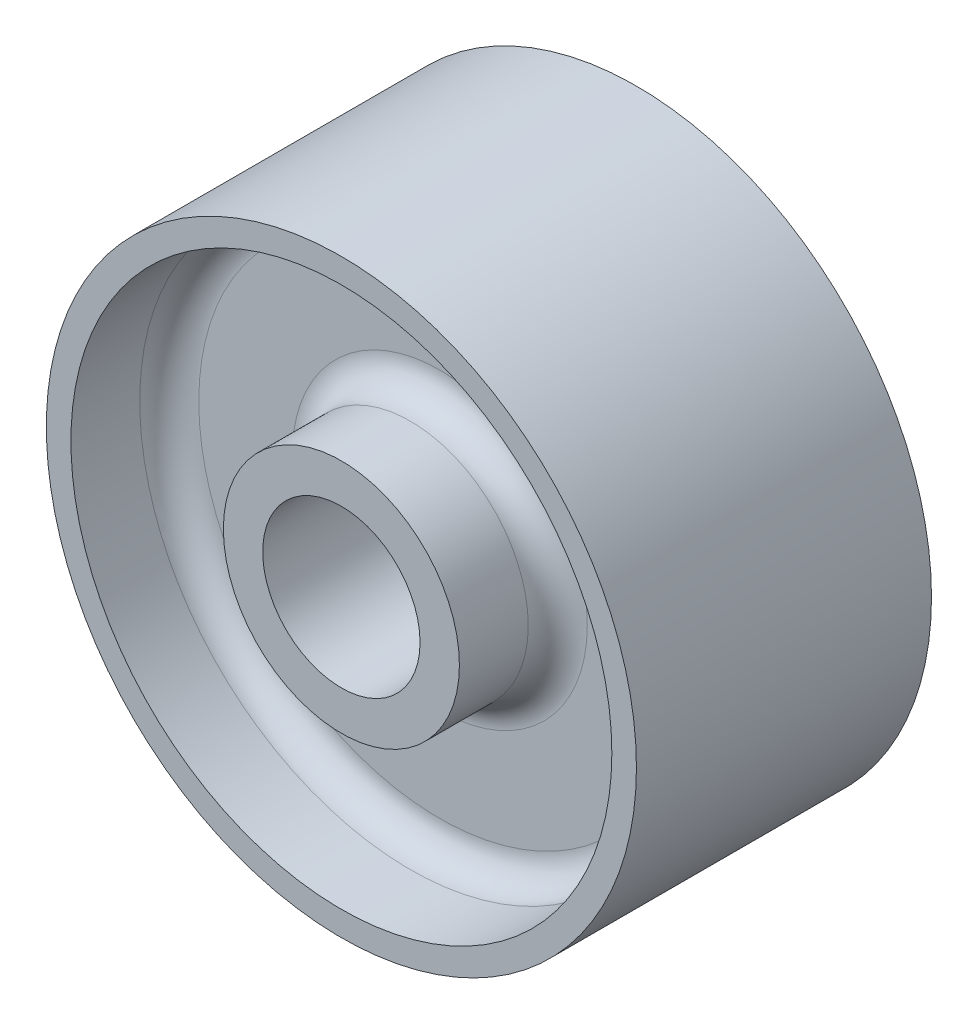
ISO-10303-21;
HEADER;
FILE_DESCRIPTION(('STEP AP214'),'2;1');
FILE_NAME('part.step','',(''),(''),'','','');
FILE_SCHEMA(('AUTOMOTIVE_DESIGN { 1 0 10303 214 1 1 1 1 }'));
ENDSEC;
DATA;
#1=APPLICATION_CONTEXT('core data for automotive mechanical design processes');
#2=APPLICATION_PROTOCOL_DEFINITION('international standard','automotive_design',2000,#1);
#3=PRODUCT_CONTEXT('',#1,'mechanical');
#4=PRODUCT('Part','Part','',(#3));
#5=PRODUCT_RELATED_PRODUCT_CATEGORY('part','',(#4));
#6=PRODUCT_DEFINITION_FORMATION('','',#4);
#7=PRODUCT_DEFINITION_CONTEXT('part definition',#1,'design');
#8=PRODUCT_DEFINITION('design','',#6,#7);
#9=PRODUCT_DEFINITION_SHAPE('','',#8);
#10=(LENGTH_UNIT() NAMED_UNIT(*) SI_UNIT(.MILLI.,.METRE.));
#11=(NAMED_UNIT(*) PLANE_ANGLE_UNIT() SI_UNIT($,.RADIAN.));
#12=(NAMED_UNIT(*) SI_UNIT($,.STERADIAN.) SOLID_ANGLE_UNIT());
#13=UNCERTAINTY_MEASURE_WITH_UNIT(LENGTH_MEASURE(1.E-05),#10,'distance_accuracy_value','');
#14=(GEOMETRIC_REPRESENTATION_CONTEXT(3) GLOBAL_UNCERTAINTY_ASSIGNED_CONTEXT((#13)) GLOBAL_UNIT_ASSIGNED_CONTEXT((#10,
#11,#12)) REPRESENTATION_CONTEXT('',''));
#15=CARTESIAN_POINT('',(0.,0.,0.));
#16=DIRECTION('',(0.,0.,1.));
#17=DIRECTION('',(1.,0.,0.));
#18=AXIS2_PLACEMENT_3D('',#15,#16,#17);
#19=CARTESIAN_POINT('',(0.,0.,0.));
#20=DIRECTION('',(0.,0.,1.));
#21=DIRECTION('',(1.,0.,0.));
#22=AXIS2_PLACEMENT_3D('',#19,#20,#21);
#23=PLANE('',#22);
#24=CARTESIAN_POINT('',(0.,0.,0.));
#25=DIRECTION('',(0.,0.,1.));
#26=DIRECTION('',(1.,0.,0.));
#27=AXIS2_PLACEMENT_3D('',#24,#25,#26);
#28=CIRCLE('',#27,16.);
#29=CARTESIAN_POINT('',(16.,0.,0.));
#30=VERTEX_POINT('',#29);
#31=EDGE_CURVE('E69',#30,#30,#28,.T.);
#32=ORIENTED_EDGE('',*,*,#31,.T.);
#33=EDGE_LOOP('',(#32));
#34=FACE_BOUND('',#33,.T.);
#35=CARTESIAN_POINT('',(0.,0.,0.));
#36=DIRECTION('',(0.,0.,-1.));
#37=DIRECTION('',(-1.,0.,0.));
#38=AXIS2_PLACEMENT_3D('',#35,#36,#37);
#39=CIRCLE('',#38,24.);
#40=CARTESIAN_POINT('',(-24.,0.,0.));
#41=VERTEX_POINT('',#40);
#42=EDGE_CURVE('E81',#41,#41,#39,.T.);
#43=ORIENTED_EDGE('',*,*,#42,.T.);
#44=EDGE_LOOP('',(#43));
#45=FACE_BOUND('',#44,.T.);
#46=ADVANCED_FACE('F28',(#34,#45),#23,.F.);
#47=CARTESIAN_POINT('',(0.,0.,60.));
#48=DIRECTION('',(0.,0.,1.));
#49=DIRECTION('',(1.,0.,0.));
#50=AXIS2_PLACEMENT_3D('',#47,#48,#49);
#51=PLANE('',#50);
#52=CARTESIAN_POINT('',(0.,0.,60.));
#53=DIRECTION('',(0.,0.,1.));
#54=DIRECTION('',(1.,0.,0.));
#55=AXIS2_PLACEMENT_3D('',#52,#53,#54);
#56=CIRCLE('',#55,16.);
#57=CARTESIAN_POINT('',(16.,0.,60.));
#58=VERTEX_POINT('',#57);
#59=EDGE_CURVE('E66',#58,#58,#56,.T.);
#60=ORIENTED_EDGE('',*,*,#59,.F.);
#61=EDGE_LOOP('',(#60));
#62=FACE_BOUND('',#61,.T.);
#63=CARTESIAN_POINT('',(0.,0.,60.));
#64=DIRECTION('',(0.,0.,1.));
#65=DIRECTION('',(1.,0.,0.));
#66=AXIS2_PLACEMENT_3D('',#63,#64,#65);
#67=CIRCLE('',#66,24.);
#68=CARTESIAN_POINT('',(24.,0.,60.));
#69=VERTEX_POINT('',#68);
#70=EDGE_CURVE('E75',#69,#69,#67,.T.);
#71=ORIENTED_EDGE('',*,*,#70,.T.);
#72=EDGE_LOOP('',(#71));
#73=FACE_BOUND('',#72,.T.);
#74=ADVANCED_FACE('F103',(#62,#73),#51,.T.);
#75=CARTESIAN_POINT('',(0.,0.,60.));
#76=DIRECTION('',(0.,0.,1.));
#77=DIRECTION('',(1.,0.,0.));
#78=AXIS2_PLACEMENT_3D('',#75,#76,#77);
#79=CIRCLE('',#78,55.);
#80=CARTESIAN_POINT('',(55.,0.,60.));
#81=VERTEX_POINT('',#80);
#82=EDGE_CURVE('E72',#81,#81,#79,.T.);
#83=ORIENTED_EDGE('',*,*,#82,.F.);
#84=EDGE_LOOP('',(#83));
#85=FACE_BOUND('',#84,.T.);
#86=CARTESIAN_POINT('',(0.,0.,60.));
#87=DIRECTION('',(0.,0.,1.));
#88=DIRECTION('',(1.,0.,0.));
#89=AXIS2_PLACEMENT_3D('',#86,#87,#88);
#90=CIRCLE('',#89,60.);
#91=CARTESIAN_POINT('',(60.,0.,60.));
#92=VERTEX_POINT('',#91);
#93=EDGE_CURVE('E60',#92,#92,#90,.T.);
#94=ORIENTED_EDGE('',*,*,#93,.T.);
#95=EDGE_LOOP('',(#94));
#96=FACE_BOUND('',#95,.T.);
#97=ADVANCED_FACE('F110',(#85,#96),#51,.T.);
#98=CARTESIAN_POINT('',(0.,0.,0.));
#99=DIRECTION('',(0.,0.,-1.));
#100=DIRECTION('',(-1.,0.,0.));
#101=AXIS2_PLACEMENT_3D('',#98,#99,#100);
#102=CIRCLE('',#101,55.);
#103=CARTESIAN_POINT('',(-55.,0.,0.));
#104=VERTEX_POINT('',#103);
#105=EDGE_CURVE('E78',#104,#104,#102,.T.);
#106=ORIENTED_EDGE('',*,*,#105,.F.);
#107=EDGE_LOOP('',(#106));
#108=FACE_BOUND('',#107,.T.);
#109=CARTESIAN_POINT('',(0.,0.,0.));
#110=DIRECTION('',(0.,0.,1.));
#111=DIRECTION('',(1.,0.,0.));
#112=AXIS2_PLACEMENT_3D('',#109,#110,#111);
#113=CIRCLE('',#112,60.);
#114=CARTESIAN_POINT('',(60.,0.,0.));
#115=VERTEX_POINT('',#114);
#116=EDGE_CURVE('E63',#115,#115,#113,.T.);
#117=ORIENTED_EDGE('',*,*,#116,.F.);
#118=EDGE_LOOP('',(#117));
#119=FACE_BOUND('',#118,.T.);
#120=ADVANCED_FACE('F106',(#108,#119),#23,.F.);
#121=CARTESIAN_POINT('',(0.,0.,60.));
#122=DIRECTION('',(0.,0.,-1.));
#123=DIRECTION('',(-1.,0.,0.));
#124=AXIS2_PLACEMENT_3D('',#121,#122,#123);
#125=CYLINDRICAL_SURFACE('',#124,60.);
#126=ORIENTED_EDGE('',*,*,#93,.F.);
#127=EDGE_LOOP('',(#126));
#128=FACE_BOUND('',#127,.T.);
#129=ORIENTED_EDGE('',*,*,#116,.T.);
#130=EDGE_LOOP('',(#129));
#131=FACE_BOUND('',#130,.T.);
#132=ADVANCED_FACE('F30',(#128,#131),#125,.T.);
#133=CARTESIAN_POINT('',(0.,0.,60.));
#134=DIRECTION('',(0.,0.,-1.));
#135=DIRECTION('',(-1.,0.,0.));
#136=AXIS2_PLACEMENT_3D('',#133,#134,#135);
#137=CYLINDRICAL_SURFACE('',#136,16.);
#138=ORIENTED_EDGE('',*,*,#59,.T.);
#139=EDGE_LOOP('',(#138));
#140=FACE_BOUND('',#139,.T.);
#141=ORIENTED_EDGE('',*,*,#31,.F.);
#142=EDGE_LOOP('',(#141));
#143=FACE_BOUND('',#142,.T.);
#144=ADVANCED_FACE('F119',(#140,#143),#137,.F.);
#145=CARTESIAN_POINT('',(0.,0.,40.));
#146=DIRECTION('',(0.,0.,1.));
#147=DIRECTION('',(1.,0.,0.));
#148=AXIS2_PLACEMENT_3D('',#145,#146,#147);
#149=CYLINDRICAL_SURFACE('',#148,55.);
#150=CARTESIAN_POINT('',(0.,0.,46.));
#151=DIRECTION('',(0.,0.,1.));
#152=DIRECTION('',(1.,0.,0.));
#153=AXIS2_PLACEMENT_3D('',#150,#151,#152);
#154=CIRCLE('',#153,55.);
#155=CARTESIAN_POINT('',(55.,0.,46.));
#156=VERTEX_POINT('',#155);
#157=EDGE_CURVE('E35',#156,#156,#154,.F.);
#158=ORIENTED_EDGE('',*,*,#157,.T.);
#159=EDGE_LOOP('',(#158));
#160=FACE_BOUND('',#159,.T.);
#161=ORIENTED_EDGE('',*,*,#82,.T.);
#162=EDGE_LOOP('',(#161));
#163=FACE_BOUND('',#162,.T.);
#164=ADVANCED_FACE('F139',(#160,#163),#149,.F.);
#165=CARTESIAN_POINT('',(0.,0.,40.));
#166=DIRECTION('',(0.,0.,1.));
#167=DIRECTION('',(1.,0.,0.));
#168=AXIS2_PLACEMENT_3D('',#165,#166,#167);
#169=PLANE('',#168);
#170=CARTESIAN_POINT('',(0.,0.,40.));
#171=DIRECTION('',(0.,0.,1.));
#172=DIRECTION('',(1.,0.,0.));
#173=AXIS2_PLACEMENT_3D('',#170,#171,#172);
#174=CIRCLE('',#173,49.);
#175=CARTESIAN_POINT('',(49.,0.,40.));
#176=VERTEX_POINT('',#175);
#177=EDGE_CURVE('E39',#176,#176,#174,.T.);
#178=ORIENTED_EDGE('',*,*,#177,.T.);
#179=EDGE_LOOP('',(#178));
#180=FACE_BOUND('',#179,.T.);
#181=CARTESIAN_POINT('',(0.,0.,40.));
#182=DIRECTION('',(0.,0.,1.));
#183=DIRECTION('',(1.,0.,0.));
#184=AXIS2_PLACEMENT_3D('',#181,#182,#183);
#185=CIRCLE('',#184,30.);
#186=CARTESIAN_POINT('',(30.,0.,40.));
#187=VERTEX_POINT('',#186);
#188=EDGE_CURVE('E43',#187,#187,#185,.F.);
#189=ORIENTED_EDGE('',*,*,#188,.T.);
#190=EDGE_LOOP('',(#189));
#191=FACE_BOUND('',#190,.T.);
#192=ADVANCED_FACE('F134',(#180,#191),#169,.T.);
#193=CARTESIAN_POINT('',(0.,0.,40.));
#194=DIRECTION('',(0.,0.,1.));
#195=DIRECTION('',(1.,0.,0.));
#196=AXIS2_PLACEMENT_3D('',#193,#194,#195);
#197=CYLINDRICAL_SURFACE('',#196,24.);
#198=CARTESIAN_POINT('',(0.,0.,46.));
#199=DIRECTION('',(0.,0.,1.));
#200=DIRECTION('',(1.,0.,0.));
#201=AXIS2_PLACEMENT_3D('',#198,#199,#200);
#202=CIRCLE('',#201,24.);
#203=CARTESIAN_POINT('',(24.,0.,46.));
#204=VERTEX_POINT('',#203);
#205=EDGE_CURVE('E10',#204,#204,#202,.T.);
#206=ORIENTED_EDGE('',*,*,#205,.T.);
#207=EDGE_LOOP('',(#206));
#208=FACE_BOUND('',#207,.T.);
#209=ORIENTED_EDGE('',*,*,#70,.F.);
#210=EDGE_LOOP('',(#209));
#211=FACE_BOUND('',#210,.T.);
#212=ADVANCED_FACE('F128',(#208,#211),#197,.T.);
#213=CARTESIAN_POINT('',(0.,0.,20.));
#214=DIRECTION('',(0.,0.,-1.));
#215=DIRECTION('',(-1.,0.,0.));
#216=AXIS2_PLACEMENT_3D('',#213,#214,#215);
#217=CYLINDRICAL_SURFACE('',#216,55.);
#218=CARTESIAN_POINT('',(0.,0.,14.));
#219=DIRECTION('',(0.,0.,-1.));
#220=DIRECTION('',(-1.,0.,0.));
#221=AXIS2_PLACEMENT_3D('',#218,#219,#220);
#222=CIRCLE('',#221,55.);
#223=CARTESIAN_POINT('',(-55.,0.,14.));
#224=VERTEX_POINT('',#223);
#225=EDGE_CURVE('E48',#224,#224,#222,.F.);
#226=ORIENTED_EDGE('',*,*,#225,.T.);
#227=EDGE_LOOP('',(#226));
#228=FACE_BOUND('',#227,.T.);
#229=ORIENTED_EDGE('',*,*,#105,.T.);
#230=EDGE_LOOP('',(#229));
#231=FACE_BOUND('',#230,.T.);
#232=ADVANCED_FACE('F99',(#228,#231),#217,.F.);
#233=CARTESIAN_POINT('',(0.,0.,20.));
#234=DIRECTION('',(0.,0.,-1.));
#235=DIRECTION('',(-1.,0.,0.));
#236=AXIS2_PLACEMENT_3D('',#233,#234,#235);
#237=PLANE('',#236);
#238=CARTESIAN_POINT('',(0.,0.,20.));
#239=DIRECTION('',(0.,0.,-1.));
#240=DIRECTION('',(-1.,0.,0.));
#241=AXIS2_PLACEMENT_3D('',#238,#239,#240);
#242=CIRCLE('',#241,30.);
#243=CARTESIAN_POINT('',(-30.,0.,20.));
#244=VERTEX_POINT('',#243);
#245=EDGE_CURVE('E51',#244,#244,#242,.F.);
#246=ORIENTED_EDGE('',*,*,#245,.T.);
#247=EDGE_LOOP('',(#246));
#248=FACE_BOUND('',#247,.T.);
#249=CARTESIAN_POINT('',(0.,0.,20.));
#250=DIRECTION('',(0.,0.,-1.));
#251=DIRECTION('',(-1.,0.,0.));
#252=AXIS2_PLACEMENT_3D('',#249,#250,#251);
#253=CIRCLE('',#252,49.);
#254=CARTESIAN_POINT('',(-49.,0.,20.));
#255=VERTEX_POINT('',#254);
#256=EDGE_CURVE('E54',#255,#255,#253,.T.);
#257=ORIENTED_EDGE('',*,*,#256,.T.);
#258=EDGE_LOOP('',(#257));
#259=FACE_BOUND('',#258,.T.);
#260=ADVANCED_FACE('F89',(#248,#259),#237,.T.);
#261=CARTESIAN_POINT('',(0.,0.,20.));
#262=DIRECTION('',(0.,0.,-1.));
#263=DIRECTION('',(-1.,0.,0.));
#264=AXIS2_PLACEMENT_3D('',#261,#262,#263);
#265=CYLINDRICAL_SURFACE('',#264,24.);
#266=CARTESIAN_POINT('',(0.,0.,14.));
#267=DIRECTION('',(0.,0.,-1.));
#268=DIRECTION('',(-1.,0.,0.));
#269=AXIS2_PLACEMENT_3D('',#266,#267,#268);
#270=CIRCLE('',#269,24.);
#271=CARTESIAN_POINT('',(-24.,0.,14.));
#272=VERTEX_POINT('',#271);
#273=EDGE_CURVE('E57',#272,#272,#270,.T.);
#274=ORIENTED_EDGE('',*,*,#273,.T.);
#275=EDGE_LOOP('',(#274));
#276=FACE_BOUND('',#275,.T.);
#277=ORIENTED_EDGE('',*,*,#42,.F.);
#278=EDGE_LOOP('',(#277));
#279=FACE_BOUND('',#278,.T.);
#280=ADVANCED_FACE('F86',(#276,#279),#265,.T.);
#281=CARTESIAN_POINT('',(0.,0.,14.));
#282=DIRECTION('',(0.,0.,-1.));
#283=DIRECTION('',(-1.,0.,0.));
#284=AXIS2_PLACEMENT_3D('',#281,#282,#283);
#285=TOROIDAL_SURFACE('',#284,30.,6.);
#286=ORIENTED_EDGE('',*,*,#245,.F.);
#287=EDGE_LOOP('',(#286));
#288=FACE_BOUND('',#287,.T.);
#289=ORIENTED_EDGE('',*,*,#273,.F.);
#290=EDGE_LOOP('',(#289));
#291=FACE_BOUND('',#290,.T.);
#292=ADVANCED_FACE('F88',(#288,#291),#285,.F.);
#293=CARTESIAN_POINT('',(0.,0.,14.));
#294=DIRECTION('',(0.,0.,-1.));
#295=DIRECTION('',(-1.,0.,0.));
#296=AXIS2_PLACEMENT_3D('',#293,#294,#295);
#297=TOROIDAL_SURFACE('',#296,49.,6.);
#298=ORIENTED_EDGE('',*,*,#225,.F.);
#299=EDGE_LOOP('',(#298));
#300=FACE_BOUND('',#299,.T.);
#301=ORIENTED_EDGE('',*,*,#256,.F.);
#302=EDGE_LOOP('',(#301));
#303=FACE_BOUND('',#302,.T.);
#304=ADVANCED_FACE('F96',(#300,#303),#297,.F.);
#305=CARTESIAN_POINT('',(0.,0.,46.));
#306=DIRECTION('',(0.,0.,1.));
#307=DIRECTION('',(1.,0.,0.));
#308=AXIS2_PLACEMENT_3D('',#305,#306,#307);
#309=TOROIDAL_SURFACE('',#308,49.,6.);
#310=ORIENTED_EDGE('',*,*,#157,.F.);
#311=EDGE_LOOP('',(#310));
#312=FACE_BOUND('',#311,.T.);
#313=ORIENTED_EDGE('',*,*,#177,.F.);
#314=EDGE_LOOP('',(#313));
#315=FACE_BOUND('',#314,.T.);
#316=ADVANCED_FACE('F174',(#312,#315),#309,.F.);
#317=CARTESIAN_POINT('',(0.,0.,46.));
#318=DIRECTION('',(0.,0.,1.));
#319=DIRECTION('',(1.,0.,0.));
#320=AXIS2_PLACEMENT_3D('',#317,#318,#319);
#321=TOROIDAL_SURFACE('',#320,30.,6.);
#322=ORIENTED_EDGE('',*,*,#188,.F.);
#323=EDGE_LOOP('',(#322));
#324=FACE_BOUND('',#323,.T.);
#325=ORIENTED_EDGE('',*,*,#205,.F.);
#326=EDGE_LOOP('',(#325));
#327=FACE_BOUND('',#326,.T.);
#328=ADVANCED_FACE('F179',(#324,#327),#321,.F.);
#329=CLOSED_SHELL('',(#46,#74,#97,#120,#132,#144,#164,#192,#212,#232,#260,#280,#292,#304,#316,#328));
#330=MANIFOLD_SOLID_BREP('B2',#329);
#331=ADVANCED_BREP_SHAPE_REPRESENTATION('',(#18,#330),#14);
#332=SHAPE_DEFINITION_REPRESENTATION(#9,#331);
ENDSEC;
END-ISO-10303-21;
